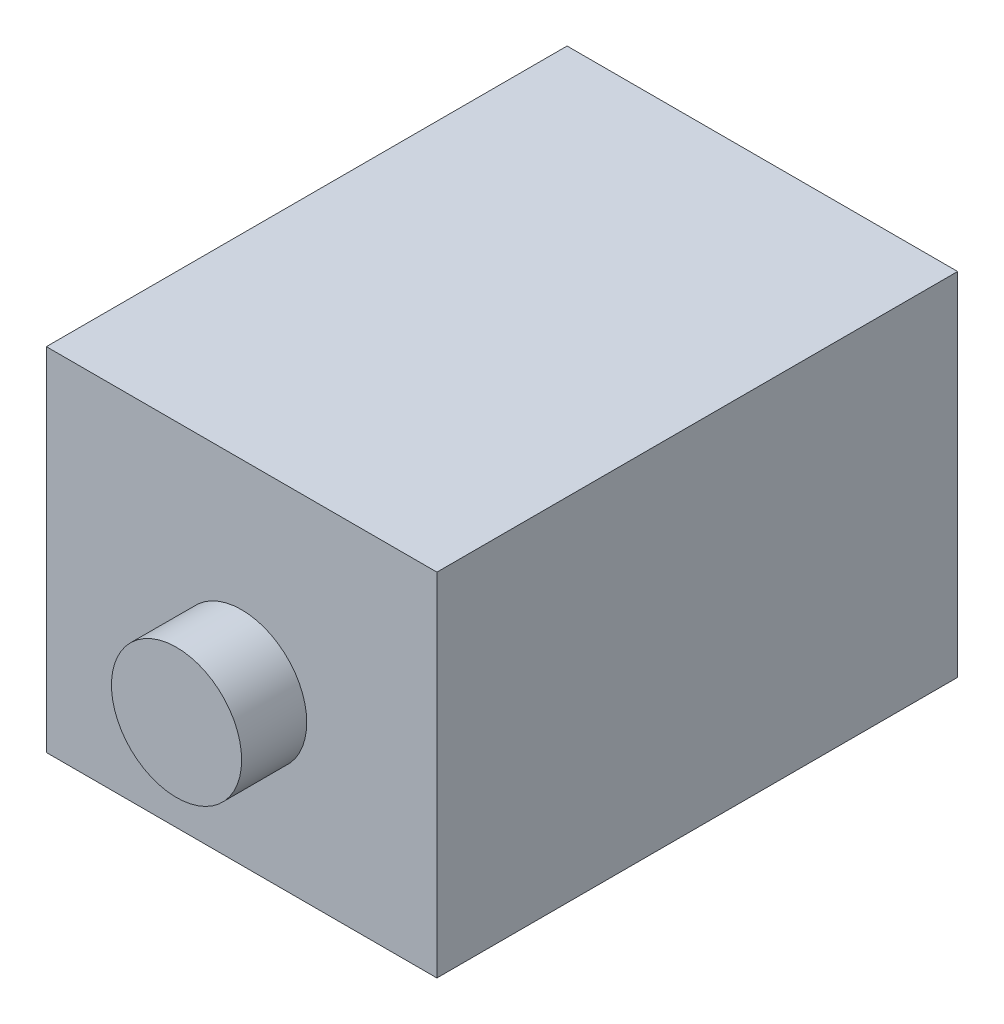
ISO-10303-21;
HEADER;
FILE_DESCRIPTION(('STEP AP214'),'2;1');
FILE_NAME('part.step','',(''),(''),'','','');
FILE_SCHEMA(('AUTOMOTIVE_DESIGN { 1 0 10303 214 1 1 1 1 }'));
ENDSEC;
DATA;
#1=APPLICATION_CONTEXT('core data for automotive mechanical design processes');
#2=APPLICATION_PROTOCOL_DEFINITION('international standard','automotive_design',2000,#1);
#3=PRODUCT_CONTEXT('',#1,'mechanical');
#4=PRODUCT('Part','Part','',(#3));
#5=PRODUCT_RELATED_PRODUCT_CATEGORY('part','',(#4));
#6=PRODUCT_DEFINITION_FORMATION('','',#4);
#7=PRODUCT_DEFINITION_CONTEXT('part definition',#1,'design');
#8=PRODUCT_DEFINITION('design','',#6,#7);
#9=PRODUCT_DEFINITION_SHAPE('','',#8);
#10=(LENGTH_UNIT() NAMED_UNIT(*) SI_UNIT(.MILLI.,.METRE.));
#11=(NAMED_UNIT(*) PLANE_ANGLE_UNIT() SI_UNIT($,.RADIAN.));
#12=(NAMED_UNIT(*) SI_UNIT($,.STERADIAN.) SOLID_ANGLE_UNIT());
#13=UNCERTAINTY_MEASURE_WITH_UNIT(LENGTH_MEASURE(1.E-05),#10,'distance_accuracy_value','');
#14=(GEOMETRIC_REPRESENTATION_CONTEXT(3) GLOBAL_UNCERTAINTY_ASSIGNED_CONTEXT((#13)) GLOBAL_UNIT_ASSIGNED_CONTEXT((#10,
#11,#12)) REPRESENTATION_CONTEXT('',''));
#15=CARTESIAN_POINT('',(0.,0.,0.));
#16=DIRECTION('',(0.,0.,1.));
#17=DIRECTION('',(1.,0.,0.));
#18=AXIS2_PLACEMENT_3D('',#15,#16,#17);
#19=CARTESIAN_POINT('',(15.,-15.,-20.));
#20=DIRECTION('',(1.,0.,0.));
#21=DIRECTION('',(0.,0.,-1.));
#22=AXIS2_PLACEMENT_3D('',#19,#20,#21);
#23=PLANE('',#22);
#24=DIRECTION('',(0.,1.,0.));
#25=VECTOR('',#24,1.);
#26=CARTESIAN_POINT('',(15.,-15.,20.));
#27=LINE('',#26,#25);
#28=CARTESIAN_POINT('',(15.,-12.,20.));
#29=VERTEX_POINT('',#28);
#30=CARTESIAN_POINT('',(15.,15.,20.));
#31=VERTEX_POINT('',#30);
#32=EDGE_CURVE('E69',#29,#31,#27,.T.);
#33=ORIENTED_EDGE('',*,*,#32,.F.);
#34=DIRECTION('',(0.,0.,1.));
#35=VECTOR('',#34,1.);
#36=CARTESIAN_POINT('',(15.,-12.,-20.));
#37=LINE('',#36,#35);
#38=CARTESIAN_POINT('',(15.,-12.,-20.));
#39=VERTEX_POINT('',#38);
#40=EDGE_CURVE('E86',#39,#29,#37,.T.);
#41=ORIENTED_EDGE('',*,*,#40,.F.);
#42=DIRECTION('',(0.,1.,0.));
#43=VECTOR('',#42,1.);
#44=CARTESIAN_POINT('',(15.,-15.,-20.));
#45=LINE('',#44,#43);
#46=CARTESIAN_POINT('',(15.,15.,-20.));
#47=VERTEX_POINT('',#46);
#48=EDGE_CURVE('E77',#39,#47,#45,.T.);
#49=ORIENTED_EDGE('',*,*,#48,.T.);
#50=DIRECTION('',(0.,0.,1.));
#51=VECTOR('',#50,1.);
#52=CARTESIAN_POINT('',(15.,15.,-20.));
#53=LINE('',#52,#51);
#54=EDGE_CURVE('E50',#47,#31,#53,.T.);
#55=ORIENTED_EDGE('',*,*,#54,.T.);
#56=EDGE_LOOP('',(#33,#41,#49,#55));
#57=FACE_BOUND('',#56,.T.);
#58=ADVANCED_FACE('F41',(#57),#23,.T.);
#59=CARTESIAN_POINT('',(-15.,-15.,-20.));
#60=DIRECTION('',(-1.,0.,0.));
#61=DIRECTION('',(0.,0.,1.));
#62=AXIS2_PLACEMENT_3D('',#59,#60,#61);
#63=PLANE('',#62);
#64=DIRECTION('',(0.,-1.,0.));
#65=VECTOR('',#64,1.);
#66=CARTESIAN_POINT('',(-15.,-15.,-20.));
#67=LINE('',#66,#65);
#68=CARTESIAN_POINT('',(-15.,15.,-20.));
#69=VERTEX_POINT('',#68);
#70=CARTESIAN_POINT('',(-15.,-12.,-20.));
#71=VERTEX_POINT('',#70);
#72=EDGE_CURVE('E114',#69,#71,#67,.T.);
#73=ORIENTED_EDGE('',*,*,#72,.T.);
#74=DIRECTION('',(0.,0.,1.));
#75=VECTOR('',#74,1.);
#76=CARTESIAN_POINT('',(-15.,-12.,-20.));
#77=LINE('',#76,#75);
#78=CARTESIAN_POINT('',(-15.,-12.,20.));
#79=VERTEX_POINT('',#78);
#80=EDGE_CURVE('E99',#71,#79,#77,.T.);
#81=ORIENTED_EDGE('',*,*,#80,.T.);
#82=DIRECTION('',(0.,-1.,0.));
#83=VECTOR('',#82,1.);
#84=CARTESIAN_POINT('',(-15.,-15.,20.));
#85=LINE('',#84,#83);
#86=CARTESIAN_POINT('',(-15.,15.,20.));
#87=VERTEX_POINT('',#86);
#88=EDGE_CURVE('E102',#87,#79,#85,.T.);
#89=ORIENTED_EDGE('',*,*,#88,.F.);
#90=DIRECTION('',(0.,0.,1.));
#91=VECTOR('',#90,1.);
#92=CARTESIAN_POINT('',(-15.,15.,-20.));
#93=LINE('',#92,#91);
#94=EDGE_CURVE('E11',#69,#87,#93,.T.);
#95=ORIENTED_EDGE('',*,*,#94,.F.);
#96=EDGE_LOOP('',(#73,#81,#89,#95));
#97=FACE_BOUND('',#96,.T.);
#98=ADVANCED_FACE('F119',(#97),#63,.T.);
#99=CARTESIAN_POINT('',(-15.,15.,-20.));
#100=DIRECTION('',(0.,1.,0.));
#101=DIRECTION('',(0.,0.,1.));
#102=AXIS2_PLACEMENT_3D('',#99,#100,#101);
#103=PLANE('',#102);
#104=DIRECTION('',(-1.,0.,0.));
#105=VECTOR('',#104,1.);
#106=CARTESIAN_POINT('',(-15.,15.,20.));
#107=LINE('',#106,#105);
#108=EDGE_CURVE('E90',#31,#87,#107,.T.);
#109=ORIENTED_EDGE('',*,*,#108,.F.);
#110=ORIENTED_EDGE('',*,*,#54,.F.);
#111=DIRECTION('',(-1.,0.,0.));
#112=VECTOR('',#111,1.);
#113=CARTESIAN_POINT('',(-15.,15.,-20.));
#114=LINE('',#113,#112);
#115=EDGE_CURVE('E111',#47,#69,#114,.T.);
#116=ORIENTED_EDGE('',*,*,#115,.T.);
#117=ORIENTED_EDGE('',*,*,#94,.T.);
#118=EDGE_LOOP('',(#109,#110,#116,#117));
#119=FACE_BOUND('',#118,.T.);
#120=ADVANCED_FACE('F118',(#119),#103,.T.);
#121=CARTESIAN_POINT('',(0.,0.,-20.));
#122=DIRECTION('',(0.,0.,-1.));
#123=DIRECTION('',(-1.,0.,0.));
#124=AXIS2_PLACEMENT_3D('',#121,#122,#123);
#125=PLANE('',#124);
#126=ORIENTED_EDGE('',*,*,#48,.F.);
#127=DIRECTION('',(1.,0.,0.));
#128=VECTOR('',#127,1.);
#129=CARTESIAN_POINT('',(-15.,-12.,-20.));
#130=LINE('',#129,#128);
#131=EDGE_CURVE('E97',#71,#39,#130,.T.);
#132=ORIENTED_EDGE('',*,*,#131,.F.);
#133=ORIENTED_EDGE('',*,*,#72,.F.);
#134=ORIENTED_EDGE('',*,*,#115,.F.);
#135=EDGE_LOOP('',(#126,#132,#133,#134));
#136=FACE_BOUND('',#135,.T.);
#137=ADVANCED_FACE('F120',(#136),#125,.T.);
#138=CARTESIAN_POINT('',(0.,0.,20.));
#139=DIRECTION('',(0.,0.,-1.));
#140=DIRECTION('',(-1.,0.,0.));
#141=AXIS2_PLACEMENT_3D('',#138,#139,#140);
#142=PLANE('',#141);
#143=CARTESIAN_POINT('',(0.,0.,20.));
#144=DIRECTION('',(0.,0.,-1.));
#145=DIRECTION('',(-1.,0.,0.));
#146=AXIS2_PLACEMENT_3D('',#143,#144,#145);
#147=CIRCLE('',#146,5.);
#148=CARTESIAN_POINT('',(-5.,0.,20.));
#149=VERTEX_POINT('',#148);
#150=EDGE_CURVE('E44',#149,#149,#147,.T.);
#151=ORIENTED_EDGE('',*,*,#150,.T.);
#152=EDGE_LOOP('',(#151));
#153=FACE_BOUND('',#152,.T.);
#154=ORIENTED_EDGE('',*,*,#88,.T.);
#155=DIRECTION('',(1.,0.,0.));
#156=VECTOR('',#155,1.);
#157=CARTESIAN_POINT('',(-15.,-12.,20.));
#158=LINE('',#157,#156);
#159=EDGE_CURVE('E96',#79,#29,#158,.T.);
#160=ORIENTED_EDGE('',*,*,#159,.T.);
#161=ORIENTED_EDGE('',*,*,#32,.T.);
#162=ORIENTED_EDGE('',*,*,#108,.T.);
#163=EDGE_LOOP('',(#154,#160,#161,#162));
#164=FACE_BOUND('',#163,.T.);
#165=ADVANCED_FACE('F101',(#153,#164),#142,.F.);
#166=CARTESIAN_POINT('',(0.,0.,25.));
#167=DIRECTION('',(0.,0.,1.));
#168=DIRECTION('',(1.,0.,0.));
#169=AXIS2_PLACEMENT_3D('',#166,#167,#168);
#170=PLANE('',#169);
#171=CARTESIAN_POINT('',(0.,0.,25.));
#172=DIRECTION('',(0.,0.,1.));
#173=DIRECTION('',(1.,0.,0.));
#174=AXIS2_PLACEMENT_3D('',#171,#172,#173);
#175=CIRCLE('',#174,5.);
#176=CARTESIAN_POINT('',(5.,0.,25.));
#177=VERTEX_POINT('',#176);
#178=EDGE_CURVE('E98',#177,#177,#175,.T.);
#179=ORIENTED_EDGE('',*,*,#178,.T.);
#180=EDGE_LOOP('',(#179));
#181=FACE_BOUND('',#180,.T.);
#182=ADVANCED_FACE('F127',(#181),#170,.T.);
#183=CARTESIAN_POINT('',(0.,0.,-25.));
#184=DIRECTION('',(0.,0.,1.));
#185=DIRECTION('',(1.,0.,0.));
#186=AXIS2_PLACEMENT_3D('',#183,#184,#185);
#187=CYLINDRICAL_SURFACE('',#186,5.);
#188=ORIENTED_EDGE('',*,*,#178,.F.);
#189=EDGE_LOOP('',(#188));
#190=FACE_BOUND('',#189,.T.);
#191=ORIENTED_EDGE('',*,*,#150,.F.);
#192=EDGE_LOOP('',(#191));
#193=FACE_BOUND('',#192,.T.);
#194=ADVANCED_FACE('F151',(#190,#193),#187,.T.);
#195=CARTESIAN_POINT('',(-15.,-12.,-20.));
#196=DIRECTION('',(0.,-1.,0.));
#197=DIRECTION('',(0.,0.,-1.));
#198=AXIS2_PLACEMENT_3D('',#195,#196,#197);
#199=PLANE('',#198);
#200=ORIENTED_EDGE('',*,*,#159,.F.);
#201=ORIENTED_EDGE('',*,*,#80,.F.);
#202=ORIENTED_EDGE('',*,*,#131,.T.);
#203=ORIENTED_EDGE('',*,*,#40,.T.);
#204=EDGE_LOOP('',(#200,#201,#202,#203));
#205=FACE_BOUND('',#204,.T.);
#206=ADVANCED_FACE('F94',(#205),#199,.T.);
#207=CLOSED_SHELL('',(#58,#98,#120,#137,#165,#182,#194,#206));
#208=MANIFOLD_SOLID_BREP('B2',#207);
#209=ADVANCED_BREP_SHAPE_REPRESENTATION('',(#18,#208),#14);
#210=SHAPE_DEFINITION_REPRESENTATION(#9,#209);
ENDSEC;
END-ISO-10303-21;
